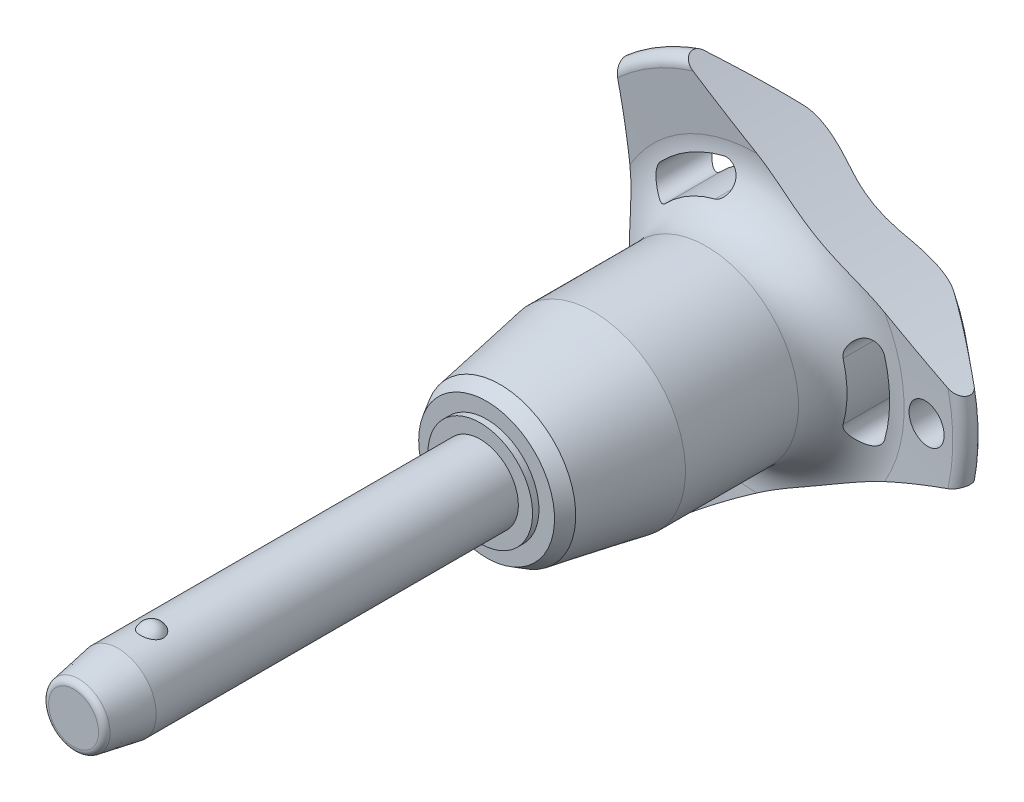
from build123d import *

# Parameters (mm, degrees)
SKETCH1_R           = 3
BOSS_EXTRUDE1_DEPTH = 25
SKETCH2_R           = 2.5
BOSS_EXTRUDE2_DEPTH = 26.7
BOSS_EXTRUDE3_START = 7
SKETCH1_2_R         = 3
BOSS_EXTRUDE3_DEPTH = 7
CHAMFER1_SIZE       = 3.5
CHAMFER1_SIZE2      = 0.617144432
FILLET1_R           = 0.5
SKETCH6_R           = 79.96
CUT_EXTRUDE1_DEPTH  = 57.781042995
CIRPATTERN1_COUNT   = 3
SKETCH7_R           = 1.5
CUT_EXTRUDE2_DEPTH  = 57.512343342


with BuildPart() as part:
    # Sketch1 → Boss-Extrude1 (new body)
    with BuildSketch(Plane.XY):
        Circle(SKETCH1_R)
    extrude(amount=-BOSS_EXTRUDE1_DEPTH)

    # Sketch2 → Boss-Extrude2 (add)
    with BuildSketch(Plane(origin=(0, 0, -25), x_dir=(-1, 0, 0), z_dir=(0, 0, -1))):
        Circle(SKETCH2_R)
    extrude(amount=BOSS_EXTRUDE2_DEPTH)

    # Sketch3 → Revolve1 (revolve)
    with BuildSketch(Plane(origin=(0, 0, 0), x_dir=(0, 0, -1), z_dir=(1, 0, 0))):
        with BuildLine():
            Line((-0.866025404, 3.5), (-0.866025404, 1.5))
            ThreePointArc((-0.866025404, 1.5), (0.133974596, 2.5), (-0.866025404, 3.5))
        make_face()
        with BuildLine():
            Line((-0.866025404, -1.5), (-0.866025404, -3.5))
            ThreePointArc((-0.866025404, -3.5), (0.133974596, -2.5), (-0.866025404, -1.5))
        make_face()
    revolve(axis=Axis((0, -1.5, 0.866025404), (0, 1, 0)))

    # Sketch1_2 → Boss-Extrude3 (add)
    with BuildSketch(Plane.XY.offset(BOSS_EXTRUDE3_START)):
        Circle(SKETCH1_2_R)
    extrude(amount=-BOSS_EXTRUDE3_DEPTH)

    # Chamfer1
    chamfer1_edges = [part.edges().sort_by_distance(p)[0] for p in [
        (-3, 0, 7),
    ]]
    chamfer1_side = [part.faces().sort_by_distance(p)[0] for p in [
        (-3, 0, -9),
    ]]
    chamfer(chamfer1_edges, length=CHAMFER1_SIZE, length2=CHAMFER1_SIZE2, reference=chamfer1_side[0])

    # Fillet1
    fillet1_edges = [part.edges().sort_by_distance(p)[0] for p in [
        (-2.382855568, 0, 7),
        (2.5, 0, -51.7),
    ]]
    fillet(fillet1_edges, radius=FILLET1_R)

    # Sketch4 → Revolve2 (revolve)
    with BuildSketch(Plane(origin=(0, 0, 0), x_dir=(0, 0, -1), z_dir=(1, 0, 0)), mode=Mode.PRIVATE) as revolve2_sk:
        Polygon((25, 0), (25, 4.118359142), (25.5, 4.118359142), (25.5, 5.343400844), (26.560917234, 5.955921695), (33.9, 7.25), (42.8, 7.25), (42.8, 0), align=None)
    revolve(revolve2_sk.sketch.rotate(Axis((0, 0, -42.8), (0, 0, 1)), 90), axis=Axis((0, 0, -42.8), (0, 0, 1)))

    # Sketch5 → Revolve3 (revolve)
    with BuildSketch(Plane(origin=(0, 0, 0), x_dir=(0, 0, -1), z_dir=(1, 0, 0)), mode=Mode.PRIVATE) as revolve3_sk:
        with BuildLine():
            Line((46.78715932, 11.570250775), (46.452568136, 15.735949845))
            ThreePointArc((46.452568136, 15.735949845), (46.946485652, 16.540188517), (47.862835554, 16.314230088))
            Line((47.862835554, 16.314230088), (51.326414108, 12.186497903))
            ThreePointArc((51.326414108, 12.186497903), (51.7, 11.109282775), (51.261488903, 10.056825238))
            ThreePointArc((51.261488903, 10.056825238), (48.289873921, 5.413681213), (47.25, 0))
            Line((47.25, 0), (42.8, 0))
            Line((42.8, 0), (42.8, 7.25))
            ThreePointArc((42.8, 7.25), (45.739473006, 8.537160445), (46.78715932, 11.570250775))
        make_face()
    revolve(revolve3_sk.sketch.rotate(Axis((0, 0, -47.25), (0, 0, 1)), 90), axis=Axis((0, 0, -47.25), (0, 0, 1)))

    # Sketch6 → Cut-Extrude1 (cut, through all)
    with BuildSketch(Plane.XY):
        with Locations((-89.76, 0)):
            Circle(SKETCH6_R)
        with BuildLine():
            ThreePointArc((10.099921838, -2.834717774), (10.490188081, 0), (10.099921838, 2.834717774))
            ThreePointArc((10.099921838, 2.834717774), (8.768180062, 3.582738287), (8.020159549, 2.250996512))
            ThreePointArc((8.020159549, 2.250996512), (8.330062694, 0), (8.020159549, -2.250996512))
            ThreePointArc((8.020159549, -2.250996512), (8.768180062, -3.582738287), (10.099921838, -2.834717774))
        make_face()
    cut_extrude1 = extrude(amount=-CUT_EXTRUDE1_DEPTH, mode=Mode.SUBTRACT)

    # CirPattern1: Cut-Extrude1 ×3 about axis
    cirpattern1_axis = Axis((0, 0, 0), (0, 0, 1))
    for i in range(1, CIRPATTERN1_COUNT):
        add(cut_extrude1.rotate(cirpattern1_axis, i * 360 / CIRPATTERN1_COUNT), mode=Mode.SUBTRACT)

    # Sketch7 → Cut-Extrude2 (cut, through all)
    with BuildSketch(Plane.XY):
        with Locations(Location((13.490188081, 0, 0), (0, 0, 225.221865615))):
            Circle(SKETCH7_R)
    extrude(amount=-CUT_EXTRUDE2_DEPTH, mode=Mode.SUBTRACT)


solid = part.part
